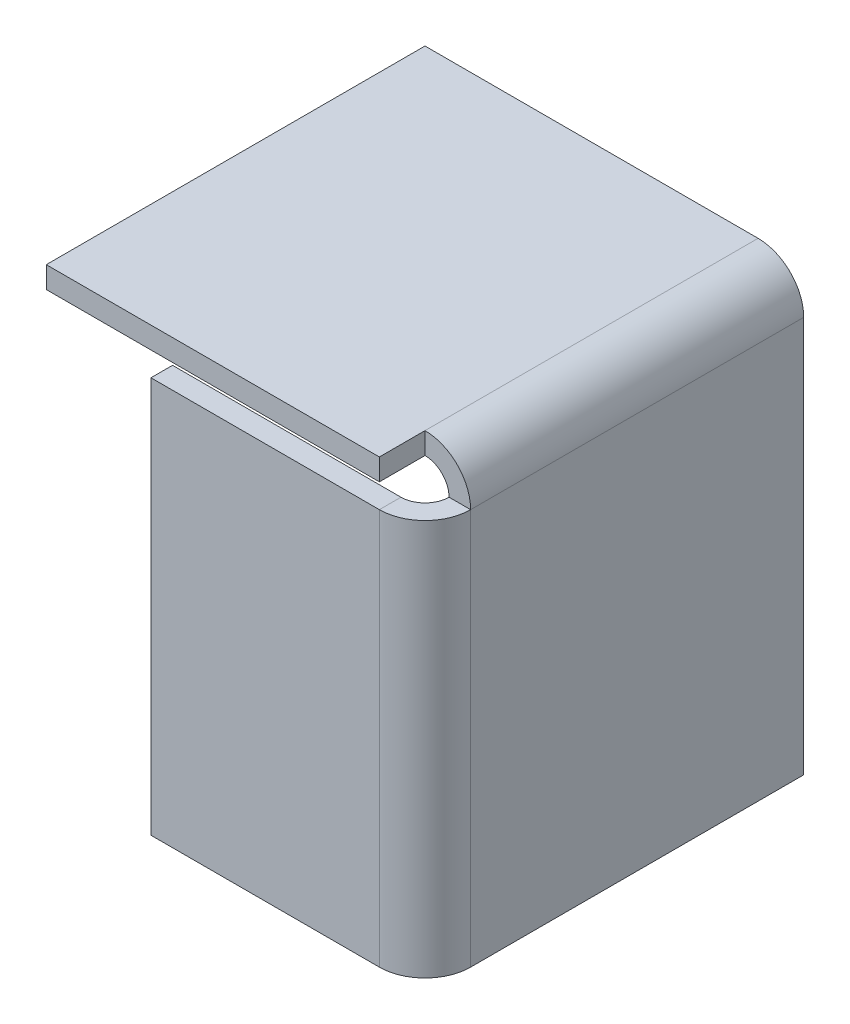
ISO-10303-21;
HEADER;
FILE_DESCRIPTION(('STEP AP214'),'2;1');
FILE_NAME('part.step','',(''),(''),'','','');
FILE_SCHEMA(('AUTOMOTIVE_DESIGN { 1 0 10303 214 1 1 1 1 }'));
ENDSEC;
DATA;
#1=APPLICATION_CONTEXT('core data for automotive mechanical design processes');
#2=APPLICATION_PROTOCOL_DEFINITION('international standard','automotive_design',2000,#1);
#3=PRODUCT_CONTEXT('',#1,'mechanical');
#4=PRODUCT('Part','Part','',(#3));
#5=PRODUCT_RELATED_PRODUCT_CATEGORY('part','',(#4));
#6=PRODUCT_DEFINITION_FORMATION('','',#4);
#7=PRODUCT_DEFINITION_CONTEXT('part definition',#1,'design');
#8=PRODUCT_DEFINITION('design','',#6,#7);
#9=PRODUCT_DEFINITION_SHAPE('','',#8);
#10=(LENGTH_UNIT() NAMED_UNIT(*) SI_UNIT(.MILLI.,.METRE.));
#11=(NAMED_UNIT(*) PLANE_ANGLE_UNIT() SI_UNIT($,.RADIAN.));
#12=(NAMED_UNIT(*) SI_UNIT($,.STERADIAN.) SOLID_ANGLE_UNIT());
#13=UNCERTAINTY_MEASURE_WITH_UNIT(LENGTH_MEASURE(1.E-05),#10,'distance_accuracy_value','');
#14=(GEOMETRIC_REPRESENTATION_CONTEXT(3) GLOBAL_UNCERTAINTY_ASSIGNED_CONTEXT((#13)) GLOBAL_UNIT_ASSIGNED_CONTEXT((#10,
#11,#12)) REPRESENTATION_CONTEXT('',''));
#15=CARTESIAN_POINT('',(0.,0.,0.));
#16=DIRECTION('',(0.,0.,1.));
#17=DIRECTION('',(1.,0.,0.));
#18=AXIS2_PLACEMENT_3D('',#15,#16,#17);
#19=CARTESIAN_POINT('',(-3.61441999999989,0.,0.));
#20=DIRECTION('',(1.,0.,0.));
#21=DIRECTION('',(0.,1.,0.));
#22=AXIS2_PLACEMENT_3D('',#19,#20,#21);
#23=PLANE('',#22);
#24=DIRECTION('',(0.,-1.,0.));
#25=VECTOR('',#24,1.);
#26=CARTESIAN_POINT('',(-3.61442000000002,35.,26.38558));
#27=LINE('',#26,#25);
#28=CARTESIAN_POINT('',(-3.61442000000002,35.,26.38558));
#29=VERTEX_POINT('',#28);
#30=CARTESIAN_POINT('',(-3.61442000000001,33.29058,26.38558));
#31=VERTEX_POINT('',#30);
#32=EDGE_CURVE('E13',#29,#31,#27,.T.);
#33=ORIENTED_EDGE('',*,*,#32,.F.);
#34=DIRECTION('',(0.,0.,-1.));
#35=VECTOR('',#34,1.);
#36=CARTESIAN_POINT('',(-3.61442000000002,35.,30.));
#37=LINE('',#36,#35);
#38=CARTESIAN_POINT('',(-3.61442000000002,35.,30.));
#39=VERTEX_POINT('',#38);
#40=EDGE_CURVE('E261',#39,#29,#37,.T.);
#41=ORIENTED_EDGE('',*,*,#40,.F.);
#42=DIRECTION('',(0.,1.,0.));
#43=VECTOR('',#42,1.);
#44=CARTESIAN_POINT('',(-3.61442000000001,33.29058,30.));
#45=LINE('',#44,#43);
#46=CARTESIAN_POINT('',(-3.61442000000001,33.29058,30.));
#47=VERTEX_POINT('',#46);
#48=EDGE_CURVE('E276',#47,#39,#45,.T.);
#49=ORIENTED_EDGE('',*,*,#48,.F.);
#50=DIRECTION('',(0.,0.,-1.));
#51=VECTOR('',#50,1.);
#52=CARTESIAN_POINT('',(-3.61442000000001,33.29058,30.));
#53=LINE('',#52,#51);
#54=EDGE_CURVE('E254',#47,#31,#53,.T.);
#55=ORIENTED_EDGE('',*,*,#54,.T.);
#56=EDGE_LOOP('',(#33,#41,#49,#55));
#57=FACE_BOUND('',#56,.T.);
#58=ADVANCED_FACE('F58',(#57),#23,.T.);
#59=CARTESIAN_POINT('',(-3.61442000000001,31.38558,30.));
#60=DIRECTION('',(0.,0.,-1.));
#61=DIRECTION('',(-1.,0.,0.));
#62=AXIS2_PLACEMENT_3D('',#59,#60,#61);
#63=CYLINDRICAL_SURFACE('',#62,3.61442);
#64=CARTESIAN_POINT('',(-3.61442000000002,35.,0.));
#65=VERTEX_POINT('',#64);
#66=EDGE_CURVE('E260',#29,#65,#37,.T.);
#67=ORIENTED_EDGE('',*,*,#66,.F.);
#68=CARTESIAN_POINT('',(-3.61442000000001,31.38558,26.38558));
#69=DIRECTION('',(0.,0.,1.));
#70=DIRECTION('',(1.,0.,0.));
#71=AXIS2_PLACEMENT_3D('',#68,#69,#70);
#72=CIRCLE('',#71,3.61442);
#73=CARTESIAN_POINT('',(0.,31.38558,26.38558));
#74=VERTEX_POINT('',#73);
#75=EDGE_CURVE('E278',#29,#74,#72,.F.);
#76=ORIENTED_EDGE('',*,*,#75,.T.);
#77=DIRECTION('',(0.,0.,-1.));
#78=VECTOR('',#77,1.);
#79=CARTESIAN_POINT('',(0.,31.38558,30.));
#80=LINE('',#79,#78);
#81=CARTESIAN_POINT('',(0.,31.38558,0.));
#82=VERTEX_POINT('',#81);
#83=EDGE_CURVE('E264',#74,#82,#80,.T.);
#84=ORIENTED_EDGE('',*,*,#83,.T.);
#85=CARTESIAN_POINT('',(-3.61442000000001,31.38558,0.));
#86=DIRECTION('',(0.,0.,1.));
#87=DIRECTION('',(1.,0.,0.));
#88=AXIS2_PLACEMENT_3D('',#85,#86,#87);
#89=CIRCLE('',#88,3.61442);
#90=EDGE_CURVE('E238',#65,#82,#89,.F.);
#91=ORIENTED_EDGE('',*,*,#90,.F.);
#92=EDGE_LOOP('',(#67,#76,#84,#91));
#93=FACE_BOUND('',#92,.T.);
#94=ADVANCED_FACE('F309',(#93),#63,.T.);
#95=CARTESIAN_POINT('',(-1.70942,35.,30.));
#96=DIRECTION('',(1.,0.,0.));
#97=DIRECTION('',(0.,1.,0.));
#98=AXIS2_PLACEMENT_3D('',#95,#96,#97);
#99=PLANE('',#98);
#100=DIRECTION('',(0.,1.,0.));
#101=VECTOR('',#100,1.);
#102=CARTESIAN_POINT('',(-1.70941999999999,31.38558,26.38558));
#103=LINE('',#102,#101);
#104=CARTESIAN_POINT('',(-1.70941999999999,31.38558,26.38558));
#105=VERTEX_POINT('',#104);
#106=CARTESIAN_POINT('',(-1.70941999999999,0.,26.38558));
#107=VERTEX_POINT('',#106);
#108=EDGE_CURVE('E210',#105,#107,#103,.F.);
#109=ORIENTED_EDGE('',*,*,#108,.F.);
#110=DIRECTION('',(0.,0.,-1.));
#111=VECTOR('',#110,1.);
#112=CARTESIAN_POINT('',(-1.70942,31.38558,30.));
#113=LINE('',#112,#111);
#114=CARTESIAN_POINT('',(-1.70942,31.38558,0.));
#115=VERTEX_POINT('',#114);
#116=EDGE_CURVE('E229',#105,#115,#113,.T.);
#117=ORIENTED_EDGE('',*,*,#116,.T.);
#118=DIRECTION('',(0.,-1.,0.));
#119=VECTOR('',#118,1.);
#120=CARTESIAN_POINT('',(-1.70942,35.,0.));
#121=LINE('',#120,#119);
#122=CARTESIAN_POINT('',(-1.70942,0.,0.));
#123=VERTEX_POINT('',#122);
#124=EDGE_CURVE('E216',#115,#123,#121,.T.);
#125=ORIENTED_EDGE('',*,*,#124,.T.);
#126=DIRECTION('',(0.,0.,-1.));
#127=VECTOR('',#126,1.);
#128=CARTESIAN_POINT('',(-1.70942,0.,30.));
#129=LINE('',#128,#127);
#130=EDGE_CURVE('E268',#107,#123,#129,.T.);
#131=ORIENTED_EDGE('',*,*,#130,.F.);
#132=EDGE_LOOP('',(#109,#117,#125,#131));
#133=FACE_BOUND('',#132,.T.);
#134=ADVANCED_FACE('F290',(#133),#99,.F.);
#135=CARTESIAN_POINT('',(0.,35.,30.));
#136=DIRECTION('',(1.,0.,0.));
#137=DIRECTION('',(0.,1.,0.));
#138=AXIS2_PLACEMENT_3D('',#135,#136,#137);
#139=PLANE('',#138);
#140=ORIENTED_EDGE('',*,*,#83,.F.);
#141=DIRECTION('',(0.,1.,0.));
#142=VECTOR('',#141,1.);
#143=CARTESIAN_POINT('',(0.,31.38558,26.38558));
#144=LINE('',#143,#142);
#145=CARTESIAN_POINT('',(0.,0.,26.38558));
#146=VERTEX_POINT('',#145);
#147=EDGE_CURVE('E156',#74,#146,#144,.F.);
#148=ORIENTED_EDGE('',*,*,#147,.T.);
#149=DIRECTION('',(0.,0.,-1.));
#150=VECTOR('',#149,1.);
#151=CARTESIAN_POINT('',(0.,0.,30.));
#152=LINE('',#151,#150);
#153=CARTESIAN_POINT('',(0.,0.,0.));
#154=VERTEX_POINT('',#153);
#155=EDGE_CURVE('E266',#146,#154,#152,.T.);
#156=ORIENTED_EDGE('',*,*,#155,.T.);
#157=DIRECTION('',(0.,-1.,0.));
#158=VECTOR('',#157,1.);
#159=CARTESIAN_POINT('',(0.,35.,0.));
#160=LINE('',#159,#158);
#161=EDGE_CURVE('E235',#82,#154,#160,.T.);
#162=ORIENTED_EDGE('',*,*,#161,.F.);
#163=EDGE_LOOP('',(#140,#148,#156,#162));
#164=FACE_BOUND('',#163,.T.);
#165=ADVANCED_FACE('F305',(#164),#139,.T.);
#166=CARTESIAN_POINT('',(-3.61442000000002,35.,0.));
#167=DIRECTION('',(0.,0.,-1.));
#168=DIRECTION('',(-1.,0.,0.));
#169=AXIS2_PLACEMENT_3D('',#166,#167,#168);
#170=PLANE('',#169);
#171=DIRECTION('',(0.,-1.,0.));
#172=VECTOR('',#171,1.);
#173=CARTESIAN_POINT('',(-3.61442000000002,35.,0.));
#174=LINE('',#173,#172);
#175=CARTESIAN_POINT('',(-3.61442000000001,33.29058,0.));
#176=VERTEX_POINT('',#175);
#177=EDGE_CURVE('E273',#65,#176,#174,.T.);
#178=ORIENTED_EDGE('',*,*,#177,.F.);
#179=ORIENTED_EDGE('',*,*,#90,.T.);
#180=DIRECTION('',(1.,0.,0.));
#181=VECTOR('',#180,1.);
#182=CARTESIAN_POINT('',(-1.70942,31.38558,0.));
#183=LINE('',#182,#181);
#184=EDGE_CURVE('E270',#115,#82,#183,.T.);
#185=ORIENTED_EDGE('',*,*,#184,.F.);
#186=CARTESIAN_POINT('',(-3.61442000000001,31.38558,0.));
#187=DIRECTION('',(0.,0.,1.));
#188=DIRECTION('',(1.,0.,0.));
#189=AXIS2_PLACEMENT_3D('',#186,#187,#188);
#190=CIRCLE('',#189,1.905);
#191=EDGE_CURVE('E223',#176,#115,#190,.F.);
#192=ORIENTED_EDGE('',*,*,#191,.F.);
#193=EDGE_LOOP('',(#178,#179,#185,#192));
#194=FACE_BOUND('',#193,.T.);
#195=ADVANCED_FACE('F314',(#194),#170,.T.);
#196=CARTESIAN_POINT('',(-1.70942,31.38558,0.));
#197=DIRECTION('',(0.,0.,-1.));
#198=DIRECTION('',(-1.,0.,0.));
#199=AXIS2_PLACEMENT_3D('',#196,#197,#198);
#200=PLANE('',#199);
#201=DIRECTION('',(1.,0.,0.));
#202=VECTOR('',#201,1.);
#203=CARTESIAN_POINT('',(-30.,35.,0.));
#204=LINE('',#203,#202);
#205=CARTESIAN_POINT('',(-30.,35.,0.));
#206=VERTEX_POINT('',#205);
#207=EDGE_CURVE('E241',#206,#65,#204,.T.);
#208=ORIENTED_EDGE('',*,*,#207,.T.);
#209=ORIENTED_EDGE('',*,*,#177,.T.);
#210=DIRECTION('',(1.,0.,0.));
#211=VECTOR('',#210,1.);
#212=CARTESIAN_POINT('',(-30.,33.29058,0.));
#213=LINE('',#212,#211);
#214=CARTESIAN_POINT('',(-30.,33.29058,0.));
#215=VERTEX_POINT('',#214);
#216=EDGE_CURVE('E247',#215,#176,#213,.T.);
#217=ORIENTED_EDGE('',*,*,#216,.F.);
#218=DIRECTION('',(0.,1.,0.));
#219=VECTOR('',#218,1.);
#220=CARTESIAN_POINT('',(-30.,33.29058,0.));
#221=LINE('',#220,#219);
#222=EDGE_CURVE('E244',#215,#206,#221,.T.);
#223=ORIENTED_EDGE('',*,*,#222,.T.);
#224=EDGE_LOOP('',(#208,#209,#217,#223));
#225=FACE_BOUND('',#224,.T.);
#226=ADVANCED_FACE('F317',(#225),#200,.T.);
#227=CARTESIAN_POINT('',(0.,0.,30.));
#228=DIRECTION('',(0.,-1.,0.));
#229=DIRECTION('',(0.,0.,-1.));
#230=AXIS2_PLACEMENT_3D('',#227,#228,#229);
#231=PLANE('',#230);
#232=DIRECTION('',(1.,0.,0.));
#233=VECTOR('',#232,1.);
#234=CARTESIAN_POINT('',(-1.70941999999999,0.,26.38558));
#235=LINE('',#234,#233);
#236=EDGE_CURVE('E213',#107,#146,#235,.T.);
#237=ORIENTED_EDGE('',*,*,#236,.F.);
#238=ORIENTED_EDGE('',*,*,#130,.T.);
#239=DIRECTION('',(-1.,0.,0.));
#240=VECTOR('',#239,1.);
#241=CARTESIAN_POINT('',(0.,0.,0.));
#242=LINE('',#241,#240);
#243=EDGE_CURVE('E232',#154,#123,#242,.T.);
#244=ORIENTED_EDGE('',*,*,#243,.F.);
#245=ORIENTED_EDGE('',*,*,#155,.F.);
#246=EDGE_LOOP('',(#237,#238,#244,#245));
#247=FACE_BOUND('',#246,.T.);
#248=ADVANCED_FACE('F300',(#247),#231,.T.);
#249=CARTESIAN_POINT('',(-3.61442000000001,31.38558,26.38558));
#250=DIRECTION('',(0.,0.,1.));
#251=DIRECTION('',(1.,0.,0.));
#252=AXIS2_PLACEMENT_3D('',#249,#250,#251);
#253=PLANE('',#252);
#254=ORIENTED_EDGE('',*,*,#75,.F.);
#255=ORIENTED_EDGE('',*,*,#32,.T.);
#256=CARTESIAN_POINT('',(-3.61442000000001,31.38558,26.38558));
#257=DIRECTION('',(0.,0.,1.));
#258=DIRECTION('',(1.,0.,0.));
#259=AXIS2_PLACEMENT_3D('',#256,#257,#258);
#260=CIRCLE('',#259,1.905);
#261=EDGE_CURVE('E65',#31,#105,#260,.F.);
#262=ORIENTED_EDGE('',*,*,#261,.T.);
#263=DIRECTION('',(1.,0.,0.));
#264=VECTOR('',#263,1.);
#265=CARTESIAN_POINT('',(-1.70941999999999,31.38558,26.38558));
#266=LINE('',#265,#264);
#267=EDGE_CURVE('E206',#105,#74,#266,.T.);
#268=ORIENTED_EDGE('',*,*,#267,.T.);
#269=EDGE_LOOP('',(#254,#255,#262,#268));
#270=FACE_BOUND('',#269,.T.);
#271=ADVANCED_FACE('F280',(#270),#253,.T.);
#272=CARTESIAN_POINT('',(-30.,35.,30.));
#273=DIRECTION('',(0.,1.,0.));
#274=DIRECTION('',(-1.,0.,0.));
#275=AXIS2_PLACEMENT_3D('',#272,#273,#274);
#276=PLANE('',#275);
#277=ORIENTED_EDGE('',*,*,#207,.F.);
#278=DIRECTION('',(0.,0.,-1.));
#279=VECTOR('',#278,1.);
#280=CARTESIAN_POINT('',(-30.,35.,30.));
#281=LINE('',#280,#279);
#282=CARTESIAN_POINT('',(-30.,35.,30.));
#283=VERTEX_POINT('',#282);
#284=EDGE_CURVE('E258',#283,#206,#281,.T.);
#285=ORIENTED_EDGE('',*,*,#284,.F.);
#286=DIRECTION('',(1.,0.,0.));
#287=VECTOR('',#286,1.);
#288=CARTESIAN_POINT('',(-30.,35.,30.));
#289=LINE('',#288,#287);
#290=EDGE_CURVE('E219',#283,#39,#289,.T.);
#291=ORIENTED_EDGE('',*,*,#290,.T.);
#292=ORIENTED_EDGE('',*,*,#40,.T.);
#293=ORIENTED_EDGE('',*,*,#66,.T.);
#294=EDGE_LOOP('',(#277,#285,#291,#292,#293));
#295=FACE_BOUND('',#294,.T.);
#296=ADVANCED_FACE('F329',(#295),#276,.T.);
#297=CARTESIAN_POINT('',(-30.,33.29058,30.));
#298=DIRECTION('',(-1.,0.,0.));
#299=DIRECTION('',(0.,0.,1.));
#300=AXIS2_PLACEMENT_3D('',#297,#298,#299);
#301=PLANE('',#300);
#302=ORIENTED_EDGE('',*,*,#222,.F.);
#303=DIRECTION('',(0.,0.,-1.));
#304=VECTOR('',#303,1.);
#305=CARTESIAN_POINT('',(-30.,33.29058,30.));
#306=LINE('',#305,#304);
#307=CARTESIAN_POINT('',(-30.,33.29058,30.));
#308=VERTEX_POINT('',#307);
#309=EDGE_CURVE('E256',#308,#215,#306,.T.);
#310=ORIENTED_EDGE('',*,*,#309,.F.);
#311=DIRECTION('',(0.,1.,0.));
#312=VECTOR('',#311,1.);
#313=CARTESIAN_POINT('',(-30.,33.29058,30.));
#314=LINE('',#313,#312);
#315=EDGE_CURVE('E222',#308,#283,#314,.T.);
#316=ORIENTED_EDGE('',*,*,#315,.T.);
#317=ORIENTED_EDGE('',*,*,#284,.T.);
#318=EDGE_LOOP('',(#302,#310,#316,#317));
#319=FACE_BOUND('',#318,.T.);
#320=ADVANCED_FACE('F326',(#319),#301,.T.);
#321=CARTESIAN_POINT('',(-30.,33.29058,30.));
#322=DIRECTION('',(0.,1.,0.));
#323=DIRECTION('',(-1.,0.,0.));
#324=AXIS2_PLACEMENT_3D('',#321,#322,#323);
#325=PLANE('',#324);
#326=ORIENTED_EDGE('',*,*,#216,.T.);
#327=EDGE_CURVE('E253',#31,#176,#53,.T.);
#328=ORIENTED_EDGE('',*,*,#327,.F.);
#329=ORIENTED_EDGE('',*,*,#54,.F.);
#330=DIRECTION('',(1.,0.,0.));
#331=VECTOR('',#330,1.);
#332=CARTESIAN_POINT('',(-30.,33.29058,30.));
#333=LINE('',#332,#331);
#334=EDGE_CURVE('E226',#308,#47,#333,.T.);
#335=ORIENTED_EDGE('',*,*,#334,.F.);
#336=ORIENTED_EDGE('',*,*,#309,.T.);
#337=EDGE_LOOP('',(#326,#328,#329,#335,#336));
#338=FACE_BOUND('',#337,.T.);
#339=ADVANCED_FACE('F321',(#338),#325,.F.);
#340=CARTESIAN_POINT('',(-3.61442000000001,31.38558,30.));
#341=DIRECTION('',(0.,0.,-1.));
#342=DIRECTION('',(-1.,0.,0.));
#343=AXIS2_PLACEMENT_3D('',#340,#341,#342);
#344=CYLINDRICAL_SURFACE('',#343,1.905);
#345=ORIENTED_EDGE('',*,*,#261,.F.);
#346=ORIENTED_EDGE('',*,*,#327,.T.);
#347=ORIENTED_EDGE('',*,*,#191,.T.);
#348=ORIENTED_EDGE('',*,*,#116,.F.);
#349=EDGE_LOOP('',(#345,#346,#347,#348));
#350=FACE_BOUND('',#349,.T.);
#351=ADVANCED_FACE('F284',(#350),#344,.F.);
#352=CARTESIAN_POINT('',(-3.61442000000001,31.38558,30.));
#353=DIRECTION('',(0.,0.,1.));
#354=DIRECTION('',(1.,0.,0.));
#355=AXIS2_PLACEMENT_3D('',#352,#353,#354);
#356=PLANE('',#355);
#357=ORIENTED_EDGE('',*,*,#334,.T.);
#358=ORIENTED_EDGE('',*,*,#48,.T.);
#359=ORIENTED_EDGE('',*,*,#290,.F.);
#360=ORIENTED_EDGE('',*,*,#315,.F.);
#361=EDGE_LOOP('',(#357,#358,#359,#360));
#362=FACE_BOUND('',#361,.T.);
#363=ADVANCED_FACE('F331',(#362),#356,.T.);
#364=CARTESIAN_POINT('',(-3.61442000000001,31.38558,0.));
#365=DIRECTION('',(0.,0.,1.));
#366=DIRECTION('',(1.,0.,0.));
#367=AXIS2_PLACEMENT_3D('',#364,#365,#366);
#368=PLANE('',#367);
#369=ORIENTED_EDGE('',*,*,#124,.F.);
#370=ORIENTED_EDGE('',*,*,#184,.T.);
#371=ORIENTED_EDGE('',*,*,#161,.T.);
#372=ORIENTED_EDGE('',*,*,#243,.T.);
#373=EDGE_LOOP('',(#369,#370,#371,#372));
#374=FACE_BOUND('',#373,.T.);
#375=ADVANCED_FACE('F311',(#374),#368,.F.);
#376=CARTESIAN_POINT('',(-3.61442,0.,26.38558));
#377=DIRECTION('',(0.,-1.,0.));
#378=DIRECTION('',(0.,0.,-1.));
#379=AXIS2_PLACEMENT_3D('',#376,#377,#378);
#380=PLANE('',#379);
#381=DIRECTION('',(0.,0.,1.));
#382=VECTOR('',#381,1.);
#383=CARTESIAN_POINT('',(-3.61442,0.,30.0000000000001));
#384=LINE('',#383,#382);
#385=CARTESIAN_POINT('',(-3.61441999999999,0.,28.29058));
#386=VERTEX_POINT('',#385);
#387=CARTESIAN_POINT('',(-3.61441999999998,0.,30.));
#388=VERTEX_POINT('',#387);
#389=EDGE_CURVE('E201',#386,#388,#384,.T.);
#390=ORIENTED_EDGE('',*,*,#389,.F.);
#391=CARTESIAN_POINT('',(-3.61442,0.,26.38558));
#392=DIRECTION('',(0.,1.,0.));
#393=DIRECTION('',(0.,0.,1.));
#394=AXIS2_PLACEMENT_3D('',#391,#392,#393);
#395=CIRCLE('',#394,1.905);
#396=EDGE_CURVE('E159',#107,#386,#395,.F.);
#397=ORIENTED_EDGE('',*,*,#396,.F.);
#398=ORIENTED_EDGE('',*,*,#236,.T.);
#399=CARTESIAN_POINT('',(-3.61442,0.,26.38558));
#400=DIRECTION('',(0.,1.,0.));
#401=DIRECTION('',(0.,0.,1.));
#402=AXIS2_PLACEMENT_3D('',#399,#400,#401);
#403=CIRCLE('',#402,3.61442);
#404=EDGE_CURVE('E205',#146,#388,#403,.F.);
#405=ORIENTED_EDGE('',*,*,#404,.T.);
#406=EDGE_LOOP('',(#390,#397,#398,#405));
#407=FACE_BOUND('',#406,.T.);
#408=ADVANCED_FACE('F297',(#407),#380,.T.);
#409=CARTESIAN_POINT('',(-3.61442,31.38558,26.38558));
#410=DIRECTION('',(0.,-1.,0.));
#411=DIRECTION('',(0.,0.,-1.));
#412=AXIS2_PLACEMENT_3D('',#409,#410,#411);
#413=PLANE('',#412);
#414=CARTESIAN_POINT('',(-3.61442,31.38558,26.38558));
#415=DIRECTION('',(0.,1.,0.));
#416=DIRECTION('',(0.,0.,1.));
#417=AXIS2_PLACEMENT_3D('',#414,#415,#416);
#418=CIRCLE('',#417,1.905);
#419=CARTESIAN_POINT('',(-3.61441999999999,31.38558,28.29058));
#420=VERTEX_POINT('',#419);
#421=EDGE_CURVE('E166',#420,#105,#418,.T.);
#422=ORIENTED_EDGE('',*,*,#421,.F.);
#423=DIRECTION('',(0.,0.,1.));
#424=VECTOR('',#423,1.);
#425=CARTESIAN_POINT('',(-3.61442,31.38558,28.29058));
#426=LINE('',#425,#424);
#427=CARTESIAN_POINT('',(-3.61442,31.38558,30.));
#428=VERTEX_POINT('',#427);
#429=EDGE_CURVE('E163',#420,#428,#426,.T.);
#430=ORIENTED_EDGE('',*,*,#429,.T.);
#431=CARTESIAN_POINT('',(-3.61442,31.38558,26.38558));
#432=DIRECTION('',(0.,1.,0.));
#433=DIRECTION('',(0.,0.,1.));
#434=AXIS2_PLACEMENT_3D('',#431,#432,#433);
#435=CIRCLE('',#434,3.61442);
#436=EDGE_CURVE('E149',#428,#74,#435,.T.);
#437=ORIENTED_EDGE('',*,*,#436,.T.);
#438=ORIENTED_EDGE('',*,*,#267,.F.);
#439=EDGE_LOOP('',(#422,#430,#437,#438));
#440=FACE_BOUND('',#439,.T.);
#441=ADVANCED_FACE('F164',(#440),#413,.F.);
#442=CARTESIAN_POINT('',(-3.61442,31.38558,26.38558));
#443=DIRECTION('',(0.,1.,0.));
#444=DIRECTION('',(0.,0.,1.));
#445=AXIS2_PLACEMENT_3D('',#442,#443,#444);
#446=CYLINDRICAL_SURFACE('',#445,3.61442);
#447=ORIENTED_EDGE('',*,*,#147,.F.);
#448=ORIENTED_EDGE('',*,*,#436,.F.);
#449=DIRECTION('',(0.,1.,0.));
#450=VECTOR('',#449,1.);
#451=CARTESIAN_POINT('',(-3.61441999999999,0.,30.));
#452=LINE('',#451,#450);
#453=EDGE_CURVE('E153',#388,#428,#452,.T.);
#454=ORIENTED_EDGE('',*,*,#453,.F.);
#455=ORIENTED_EDGE('',*,*,#404,.F.);
#456=EDGE_LOOP('',(#447,#448,#454,#455));
#457=FACE_BOUND('',#456,.T.);
#458=ADVANCED_FACE('F151',(#457),#446,.T.);
#459=CARTESIAN_POINT('',(-3.61442,31.38558,26.38558));
#460=DIRECTION('',(0.,1.,0.));
#461=DIRECTION('',(0.,0.,1.));
#462=AXIS2_PLACEMENT_3D('',#459,#460,#461);
#463=CYLINDRICAL_SURFACE('',#462,1.905);
#464=ORIENTED_EDGE('',*,*,#108,.T.);
#465=ORIENTED_EDGE('',*,*,#396,.T.);
#466=DIRECTION('',(0.,-1.,0.));
#467=VECTOR('',#466,1.);
#468=CARTESIAN_POINT('',(-3.61441999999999,0.,28.29058));
#469=LINE('',#468,#467);
#470=EDGE_CURVE('E171',#386,#420,#469,.F.);
#471=ORIENTED_EDGE('',*,*,#470,.T.);
#472=ORIENTED_EDGE('',*,*,#421,.T.);
#473=EDGE_LOOP('',(#464,#465,#471,#472));
#474=FACE_BOUND('',#473,.T.);
#475=ADVANCED_FACE('F293',(#474),#463,.F.);
#476=CARTESIAN_POINT('',(-1.70942,31.38558,30.));
#477=DIRECTION('',(0.,1.,0.));
#478=DIRECTION('',(0.,0.,1.));
#479=AXIS2_PLACEMENT_3D('',#476,#477,#478);
#480=PLANE('',#479);
#481=DIRECTION('',(1.,0.,0.));
#482=VECTOR('',#481,1.);
#483=CARTESIAN_POINT('',(-1.70942,31.38558,30.));
#484=LINE('',#483,#482);
#485=CARTESIAN_POINT('',(-21.70942,31.38558,30.0000000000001));
#486=VERTEX_POINT('',#485);
#487=EDGE_CURVE('E178',#486,#428,#484,.T.);
#488=ORIENTED_EDGE('',*,*,#487,.T.);
#489=ORIENTED_EDGE('',*,*,#429,.F.);
#490=DIRECTION('',(-1.,0.,0.));
#491=VECTOR('',#490,1.);
#492=CARTESIAN_POINT('',(1.04083408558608E-13,31.38558,28.29058));
#493=LINE('',#492,#491);
#494=CARTESIAN_POINT('',(-21.70942,31.38558,28.2905800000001));
#495=VERTEX_POINT('',#494);
#496=EDGE_CURVE('E194',#495,#420,#493,.F.);
#497=ORIENTED_EDGE('',*,*,#496,.F.);
#498=DIRECTION('',(0.,0.,-1.));
#499=VECTOR('',#498,1.);
#500=CARTESIAN_POINT('',(-21.70942,31.38558,30.0000000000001));
#501=LINE('',#500,#499);
#502=EDGE_CURVE('E183',#486,#495,#501,.T.);
#503=ORIENTED_EDGE('',*,*,#502,.F.);
#504=EDGE_LOOP('',(#488,#489,#497,#503));
#505=FACE_BOUND('',#504,.T.);
#506=ADVANCED_FACE('F182',(#505),#480,.T.);
#507=CARTESIAN_POINT('',(-21.70942,0.,30.0000000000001));
#508=DIRECTION('',(0.,-1.,0.));
#509=DIRECTION('',(1.,0.,0.));
#510=AXIS2_PLACEMENT_3D('',#507,#508,#509);
#511=PLANE('',#510);
#512=DIRECTION('',(1.,0.,0.));
#513=VECTOR('',#512,1.);
#514=CARTESIAN_POINT('',(1.04083408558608E-13,0.,28.29058));
#515=LINE('',#514,#513);
#516=CARTESIAN_POINT('',(-21.70942,0.,28.2905800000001));
#517=VERTEX_POINT('',#516);
#518=EDGE_CURVE('E180',#386,#517,#515,.F.);
#519=ORIENTED_EDGE('',*,*,#518,.F.);
#520=ORIENTED_EDGE('',*,*,#389,.T.);
#521=DIRECTION('',(-1.,0.,0.));
#522=VECTOR('',#521,1.);
#523=CARTESIAN_POINT('',(-21.70942,0.,30.0000000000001));
#524=LINE('',#523,#522);
#525=CARTESIAN_POINT('',(-21.70942,0.,30.0000000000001));
#526=VERTEX_POINT('',#525);
#527=EDGE_CURVE('E179',#388,#526,#524,.T.);
#528=ORIENTED_EDGE('',*,*,#527,.T.);
#529=DIRECTION('',(0.,0.,-1.));
#530=VECTOR('',#529,1.);
#531=CARTESIAN_POINT('',(-21.70942,0.,30.0000000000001));
#532=LINE('',#531,#530);
#533=EDGE_CURVE('E185',#526,#517,#532,.T.);
#534=ORIENTED_EDGE('',*,*,#533,.T.);
#535=EDGE_LOOP('',(#519,#520,#528,#534));
#536=FACE_BOUND('',#535,.T.);
#537=ADVANCED_FACE('F424',(#536),#511,.T.);
#538=CARTESIAN_POINT('',(1.10051816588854E-13,0.,30.));
#539=DIRECTION('',(0.,0.,1.));
#540=DIRECTION('',(1.,0.,0.));
#541=AXIS2_PLACEMENT_3D('',#538,#539,#540);
#542=PLANE('',#541);
#543=ORIENTED_EDGE('',*,*,#527,.F.);
#544=ORIENTED_EDGE('',*,*,#453,.T.);
#545=ORIENTED_EDGE('',*,*,#487,.F.);
#546=DIRECTION('',(0.,1.,0.));
#547=VECTOR('',#546,1.);
#548=CARTESIAN_POINT('',(-21.70942,31.38558,30.0000000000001));
#549=LINE('',#548,#547);
#550=EDGE_CURVE('E186',#526,#486,#549,.T.);
#551=ORIENTED_EDGE('',*,*,#550,.F.);
#552=EDGE_LOOP('',(#543,#544,#545,#551));
#553=FACE_BOUND('',#552,.T.);
#554=ADVANCED_FACE('F176',(#553),#542,.T.);
#555=CARTESIAN_POINT('',(1.04083408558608E-13,0.,28.29058));
#556=DIRECTION('',(0.,0.,1.));
#557=DIRECTION('',(1.,0.,0.));
#558=AXIS2_PLACEMENT_3D('',#555,#556,#557);
#559=PLANE('',#558);
#560=ORIENTED_EDGE('',*,*,#470,.F.);
#561=ORIENTED_EDGE('',*,*,#518,.T.);
#562=DIRECTION('',(0.,-1.,0.));
#563=VECTOR('',#562,1.);
#564=CARTESIAN_POINT('',(-21.70942,0.,28.2905800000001));
#565=LINE('',#564,#563);
#566=EDGE_CURVE('E196',#517,#495,#565,.F.);
#567=ORIENTED_EDGE('',*,*,#566,.T.);
#568=ORIENTED_EDGE('',*,*,#496,.T.);
#569=EDGE_LOOP('',(#560,#561,#567,#568));
#570=FACE_BOUND('',#569,.T.);
#571=ADVANCED_FACE('F444',(#570),#559,.F.);
#572=CARTESIAN_POINT('',(-21.70942,31.38558,30.0000000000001));
#573=DIRECTION('',(-1.,0.,0.));
#574=DIRECTION('',(0.,0.,1.));
#575=AXIS2_PLACEMENT_3D('',#572,#573,#574);
#576=PLANE('',#575);
#577=ORIENTED_EDGE('',*,*,#566,.F.);
#578=ORIENTED_EDGE('',*,*,#533,.F.);
#579=ORIENTED_EDGE('',*,*,#550,.T.);
#580=ORIENTED_EDGE('',*,*,#502,.T.);
#581=EDGE_LOOP('',(#577,#578,#579,#580));
#582=FACE_BOUND('',#581,.T.);
#583=ADVANCED_FACE('F454',(#582),#576,.T.);
#584=CLOSED_SHELL('',(#58,#94,#134,#165,#195,#226,#248,#271,#296,#320,#339,#351,#363,#375,#408,
#441,#458,#475,#506,#537,#554,#571,#583));
#585=MANIFOLD_SOLID_BREP('B2',#584);
#586=ADVANCED_BREP_SHAPE_REPRESENTATION('',(#18,#585),#14);
#587=SHAPE_DEFINITION_REPRESENTATION(#9,#586);
ENDSEC;
END-ISO-10303-21;
